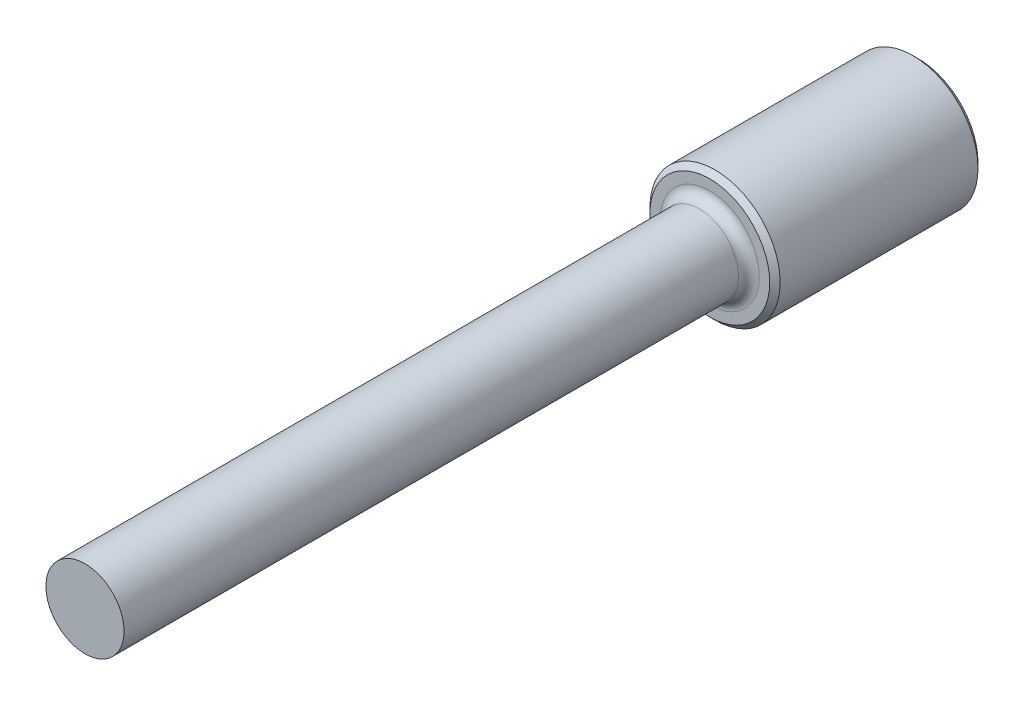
ISO-10303-21;
HEADER;
FILE_DESCRIPTION(('STEP AP214'),'2;1');
FILE_NAME('part.step','',(''),(''),'','','');
FILE_SCHEMA(('AUTOMOTIVE_DESIGN { 1 0 10303 214 1 1 1 1 }'));
ENDSEC;
DATA;
#1=APPLICATION_CONTEXT('core data for automotive mechanical design processes');
#2=APPLICATION_PROTOCOL_DEFINITION('international standard','automotive_design',2000,#1);
#3=PRODUCT_CONTEXT('',#1,'mechanical');
#4=PRODUCT('Part','Part','',(#3));
#5=PRODUCT_RELATED_PRODUCT_CATEGORY('part','',(#4));
#6=PRODUCT_DEFINITION_FORMATION('','',#4);
#7=PRODUCT_DEFINITION_CONTEXT('part definition',#1,'design');
#8=PRODUCT_DEFINITION('design','',#6,#7);
#9=PRODUCT_DEFINITION_SHAPE('','',#8);
#10=(LENGTH_UNIT() NAMED_UNIT(*) SI_UNIT(.MILLI.,.METRE.));
#11=(NAMED_UNIT(*) PLANE_ANGLE_UNIT() SI_UNIT($,.RADIAN.));
#12=(NAMED_UNIT(*) SI_UNIT($,.STERADIAN.) SOLID_ANGLE_UNIT());
#13=UNCERTAINTY_MEASURE_WITH_UNIT(LENGTH_MEASURE(1.E-05),#10,'distance_accuracy_value','');
#14=(GEOMETRIC_REPRESENTATION_CONTEXT(3) GLOBAL_UNCERTAINTY_ASSIGNED_CONTEXT((#13)) GLOBAL_UNIT_ASSIGNED_CONTEXT((#10,
#11,#12)) REPRESENTATION_CONTEXT('',''));
#15=CARTESIAN_POINT('',(0.,0.,0.));
#16=DIRECTION('',(0.,0.,1.));
#17=DIRECTION('',(1.,0.,0.));
#18=AXIS2_PLACEMENT_3D('',#15,#16,#17);
#19=CARTESIAN_POINT('',(0.,0.,8.));
#20=DIRECTION('',(0.,0.,1.));
#21=DIRECTION('',(1.,0.,0.));
#22=AXIS2_PLACEMENT_3D('',#19,#20,#21);
#23=PLANE('',#22);
#24=CARTESIAN_POINT('',(0.,0.,8.));
#25=DIRECTION('',(0.,0.,1.));
#26=DIRECTION('',(1.,0.,0.));
#27=AXIS2_PLACEMENT_3D('',#24,#25,#26);
#28=CIRCLE('',#27,1.9);
#29=CARTESIAN_POINT('',(1.9,0.,8.));
#30=VERTEX_POINT('',#29);
#31=EDGE_CURVE('E11',#30,#30,#28,.F.);
#32=ORIENTED_EDGE('',*,*,#31,.T.);
#33=EDGE_LOOP('',(#32));
#34=FACE_BOUND('',#33,.T.);
#35=CARTESIAN_POINT('',(0.,0.,8.));
#36=DIRECTION('',(0.,0.,1.));
#37=DIRECTION('',(1.,0.,0.));
#38=AXIS2_PLACEMENT_3D('',#35,#36,#37);
#39=CIRCLE('',#38,2.3);
#40=CARTESIAN_POINT('',(2.3,0.,8.));
#41=VERTEX_POINT('',#40);
#42=EDGE_CURVE('E62',#41,#41,#39,.T.);
#43=ORIENTED_EDGE('',*,*,#42,.T.);
#44=EDGE_LOOP('',(#43));
#45=FACE_BOUND('',#44,.T.);
#46=ADVANCED_FACE('F38',(#34,#45),#23,.T.);
#47=CARTESIAN_POINT('',(0.,0.,8.));
#48=DIRECTION('',(0.,0.,-1.));
#49=DIRECTION('',(-1.,0.,0.));
#50=AXIS2_PLACEMENT_3D('',#47,#48,#49);
#51=CYLINDRICAL_SURFACE('',#50,2.5);
#52=CARTESIAN_POINT('',(0.,0.,7.8));
#53=DIRECTION('',(0.,0.,1.));
#54=DIRECTION('',(1.,0.,0.));
#55=AXIS2_PLACEMENT_3D('',#52,#53,#54);
#56=CIRCLE('',#55,2.5);
#57=CARTESIAN_POINT('',(2.5,0.,7.8));
#58=VERTEX_POINT('',#57);
#59=EDGE_CURVE('E72',#58,#58,#56,.F.);
#60=ORIENTED_EDGE('',*,*,#59,.T.);
#61=EDGE_LOOP('',(#60));
#62=FACE_BOUND('',#61,.T.);
#63=CARTESIAN_POINT('',(0.,0.,0.200000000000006));
#64=DIRECTION('',(0.,0.,1.));
#65=DIRECTION('',(1.,0.,0.));
#66=AXIS2_PLACEMENT_3D('',#63,#64,#65);
#67=CIRCLE('',#66,2.5);
#68=CARTESIAN_POINT('',(2.5,0.,0.200000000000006));
#69=VERTEX_POINT('',#68);
#70=EDGE_CURVE('E69',#69,#69,#67,.T.);
#71=ORIENTED_EDGE('',*,*,#70,.T.);
#72=EDGE_LOOP('',(#71));
#73=FACE_BOUND('',#72,.T.);
#74=ADVANCED_FACE('F93',(#62,#73),#51,.T.);
#75=CARTESIAN_POINT('',(0.,0.,0.));
#76=DIRECTION('',(0.,0.,1.));
#77=DIRECTION('',(1.,0.,0.));
#78=AXIS2_PLACEMENT_3D('',#75,#76,#77);
#79=PLANE('',#78);
#80=CARTESIAN_POINT('',(0.,0.,0.));
#81=DIRECTION('',(0.,0.,1.));
#82=DIRECTION('',(1.,0.,0.));
#83=AXIS2_PLACEMENT_3D('',#80,#81,#82);
#84=CIRCLE('',#83,2.3);
#85=CARTESIAN_POINT('',(2.3,0.,0.));
#86=VERTEX_POINT('',#85);
#87=EDGE_CURVE('E75',#86,#86,#84,.F.);
#88=ORIENTED_EDGE('',*,*,#87,.T.);
#89=EDGE_LOOP('',(#88));
#90=FACE_BOUND('',#89,.T.);
#91=CARTESIAN_POINT('',(0.,0.,0.));
#92=DIRECTION('',(0.,0.,-1.));
#93=DIRECTION('',(-1.,0.,0.));
#94=AXIS2_PLACEMENT_3D('',#91,#92,#93);
#95=CIRCLE('',#94,1.24999999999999);
#96=CARTESIAN_POINT('',(-1.24999999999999,0.,0.));
#97=VERTEX_POINT('',#96);
#98=EDGE_CURVE('E59',#97,#97,#95,.T.);
#99=ORIENTED_EDGE('',*,*,#98,.F.);
#100=EDGE_LOOP('',(#99));
#101=FACE_BOUND('',#100,.T.);
#102=ADVANCED_FACE('F99',(#90,#101),#79,.F.);
#103=CARTESIAN_POINT('',(0.,0.,32.));
#104=DIRECTION('',(0.,0.,-1.));
#105=DIRECTION('',(-1.,0.,0.));
#106=AXIS2_PLACEMENT_3D('',#103,#104,#105);
#107=CYLINDRICAL_SURFACE('',#106,1.5);
#108=CARTESIAN_POINT('',(0.,0.,8.4));
#109=DIRECTION('',(0.,0.,1.));
#110=DIRECTION('',(1.,0.,0.));
#111=AXIS2_PLACEMENT_3D('',#108,#109,#110);
#112=CIRCLE('',#111,1.5);
#113=CARTESIAN_POINT('',(1.5,0.,8.4));
#114=VERTEX_POINT('',#113);
#115=EDGE_CURVE('E45',#114,#114,#112,.T.);
#116=ORIENTED_EDGE('',*,*,#115,.T.);
#117=EDGE_LOOP('',(#116));
#118=FACE_BOUND('',#117,.T.);
#119=CARTESIAN_POINT('',(0.,0.,32.));
#120=DIRECTION('',(0.,0.,1.));
#121=DIRECTION('',(1.,0.,0.));
#122=AXIS2_PLACEMENT_3D('',#119,#120,#121);
#123=CIRCLE('',#122,1.5);
#124=CARTESIAN_POINT('',(1.5,0.,32.));
#125=VERTEX_POINT('',#124);
#126=EDGE_CURVE('E58',#125,#125,#123,.T.);
#127=ORIENTED_EDGE('',*,*,#126,.F.);
#128=EDGE_LOOP('',(#127));
#129=FACE_BOUND('',#128,.T.);
#130=ADVANCED_FACE('F80',(#118,#129),#107,.T.);
#131=CARTESIAN_POINT('',(0.,0.,32.));
#132=DIRECTION('',(0.,0.,1.));
#133=DIRECTION('',(1.,0.,0.));
#134=AXIS2_PLACEMENT_3D('',#131,#132,#133);
#135=PLANE('',#134);
#136=ORIENTED_EDGE('',*,*,#126,.T.);
#137=EDGE_LOOP('',(#136));
#138=FACE_BOUND('',#137,.T.);
#139=ADVANCED_FACE('F52',(#138),#135,.T.);
#140=CARTESIAN_POINT('',(0.,0.,7.49999999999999));
#141=DIRECTION('',(0.,0.,-1.));
#142=DIRECTION('',(-1.,0.,0.));
#143=AXIS2_PLACEMENT_3D('',#140,#141,#142);
#144=CONICAL_SURFACE('',#143,1.24999999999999,1.02974425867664);
#145=CARTESIAN_POINT('',(0.,0.,8.25107577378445));
#146=VERTEX_POINT('',#145);
#147=VERTEX_LOOP('',#146);
#148=FACE_BOUND('',#147,.T.);
#149=CARTESIAN_POINT('',(0.,0.,7.49999999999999));
#150=DIRECTION('',(0.,0.,-1.));
#151=DIRECTION('',(-1.,0.,0.));
#152=AXIS2_PLACEMENT_3D('',#149,#150,#151);
#153=CIRCLE('',#152,1.24999999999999);
#154=CARTESIAN_POINT('',(-1.24999999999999,0.,7.49999999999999));
#155=VERTEX_POINT('',#154);
#156=EDGE_CURVE('E56',#155,#155,#153,.T.);
#157=ORIENTED_EDGE('',*,*,#156,.T.);
#158=EDGE_LOOP('',(#157));
#159=FACE_BOUND('',#158,.T.);
#160=ADVANCED_FACE('F48',(#148,#159),#144,.F.);
#161=CARTESIAN_POINT('',(0.,0.,0.));
#162=DIRECTION('',(0.,0.,-1.));
#163=DIRECTION('',(-1.,0.,0.));
#164=AXIS2_PLACEMENT_3D('',#161,#162,#163);
#165=CYLINDRICAL_SURFACE('',#164,1.24999999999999);
#166=ORIENTED_EDGE('',*,*,#156,.F.);
#167=EDGE_LOOP('',(#166));
#168=FACE_BOUND('',#167,.T.);
#169=ORIENTED_EDGE('',*,*,#98,.T.);
#170=EDGE_LOOP('',(#169));
#171=FACE_BOUND('',#170,.T.);
#172=ADVANCED_FACE('F51',(#168,#171),#165,.F.);
#173=CARTESIAN_POINT('',(0.,0.,8.));
#174=DIRECTION('',(0.,0.,-1.));
#175=DIRECTION('',(-1.,0.,0.));
#176=AXIS2_PLACEMENT_3D('',#173,#174,#175);
#177=CONICAL_SURFACE('',#176,2.3,0.785398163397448);
#178=ORIENTED_EDGE('',*,*,#59,.F.);
#179=EDGE_LOOP('',(#178));
#180=FACE_BOUND('',#179,.T.);
#181=ORIENTED_EDGE('',*,*,#42,.F.);
#182=EDGE_LOOP('',(#181));
#183=FACE_BOUND('',#182,.T.);
#184=ADVANCED_FACE('F89',(#180,#183),#177,.T.);
#185=CARTESIAN_POINT('',(0.,0.,0.200000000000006));
#186=DIRECTION('',(0.,0.,1.));
#187=DIRECTION('',(1.,0.,0.));
#188=AXIS2_PLACEMENT_3D('',#185,#186,#187);
#189=CONICAL_SURFACE('',#188,2.5,0.785398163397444);
#190=ORIENTED_EDGE('',*,*,#87,.F.);
#191=EDGE_LOOP('',(#190));
#192=FACE_BOUND('',#191,.T.);
#193=ORIENTED_EDGE('',*,*,#70,.F.);
#194=EDGE_LOOP('',(#193));
#195=FACE_BOUND('',#194,.T.);
#196=ADVANCED_FACE('F84',(#192,#195),#189,.T.);
#197=CARTESIAN_POINT('',(0.,0.,8.4));
#198=DIRECTION('',(0.,0.,1.));
#199=DIRECTION('',(1.,0.,0.));
#200=AXIS2_PLACEMENT_3D('',#197,#198,#199);
#201=TOROIDAL_SURFACE('',#200,1.9,0.4);
#202=ORIENTED_EDGE('',*,*,#31,.F.);
#203=EDGE_LOOP('',(#202));
#204=FACE_BOUND('',#203,.T.);
#205=ORIENTED_EDGE('',*,*,#115,.F.);
#206=EDGE_LOOP('',(#205));
#207=FACE_BOUND('',#206,.T.);
#208=ADVANCED_FACE('F40',(#204,#207),#201,.F.);
#209=CLOSED_SHELL('',(#46,#74,#102,#130,#139,#160,#172,#184,#196,#208));
#210=MANIFOLD_SOLID_BREP('B2',#209);
#211=ADVANCED_BREP_SHAPE_REPRESENTATION('',(#18,#210),#14);
#212=SHAPE_DEFINITION_REPRESENTATION(#9,#211);
ENDSEC;
END-ISO-10303-21;
